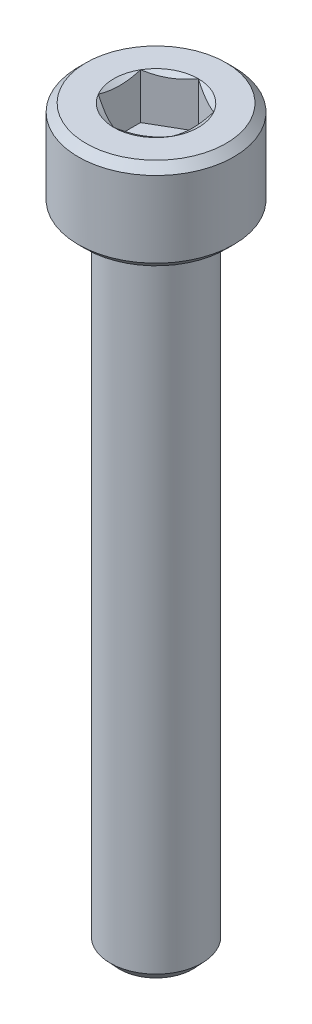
ISO-10303-21;
HEADER;
FILE_DESCRIPTION(('STEP AP214'),'2;1');
FILE_NAME('part.step','',(''),(''),'','','');
FILE_SCHEMA(('AUTOMOTIVE_DESIGN { 1 0 10303 214 1 1 1 1 }'));
ENDSEC;
DATA;
#1=APPLICATION_CONTEXT('core data for automotive mechanical design processes');
#2=APPLICATION_PROTOCOL_DEFINITION('international standard','automotive_design',2000,#1);
#3=PRODUCT_CONTEXT('',#1,'mechanical');
#4=PRODUCT('Part','Part','',(#3));
#5=PRODUCT_RELATED_PRODUCT_CATEGORY('part','',(#4));
#6=PRODUCT_DEFINITION_FORMATION('','',#4);
#7=PRODUCT_DEFINITION_CONTEXT('part definition',#1,'design');
#8=PRODUCT_DEFINITION('design','',#6,#7);
#9=PRODUCT_DEFINITION_SHAPE('','',#8);
#10=(LENGTH_UNIT() NAMED_UNIT(*) SI_UNIT(.MILLI.,.METRE.));
#11=(NAMED_UNIT(*) PLANE_ANGLE_UNIT() SI_UNIT($,.RADIAN.));
#12=(NAMED_UNIT(*) SI_UNIT($,.STERADIAN.) SOLID_ANGLE_UNIT());
#13=UNCERTAINTY_MEASURE_WITH_UNIT(LENGTH_MEASURE(1.E-05),#10,'distance_accuracy_value','');
#14=(GEOMETRIC_REPRESENTATION_CONTEXT(3) GLOBAL_UNCERTAINTY_ASSIGNED_CONTEXT((#13)) GLOBAL_UNIT_ASSIGNED_CONTEXT((#10,
#11,#12)) REPRESENTATION_CONTEXT('',''));
#15=CARTESIAN_POINT('',(0.,0.,0.));
#16=DIRECTION('',(0.,0.,1.));
#17=DIRECTION('',(1.,0.,0.));
#18=AXIS2_PLACEMENT_3D('',#15,#16,#17);
#19=CARTESIAN_POINT('',(0.,2.5,-2.3094010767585));
#20=DIRECTION('',(0.,1.,0.));
#21=DIRECTION('',(-1.,0.,0.));
#22=AXIS2_PLACEMENT_3D('',#19,#20,#21);
#23=PLANE('',#22);
#24=DIRECTION('',(0.866025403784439,0.,-0.499999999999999));
#25=VECTOR('',#24,1.);
#26=CARTESIAN_POINT('',(0.,2.5,2.30940107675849));
#27=LINE('',#26,#25);
#28=CARTESIAN_POINT('',(0.,2.5,2.3094010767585));
#29=VERTEX_POINT('',#28);
#30=CARTESIAN_POINT('',(1.99999999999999,2.5,1.15470053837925));
#31=VERTEX_POINT('',#30);
#32=EDGE_CURVE('E85',#29,#31,#27,.T.);
#33=ORIENTED_EDGE('',*,*,#32,.T.);
#34=DIRECTION('',(0.,0.,-1.));
#35=VECTOR('',#34,1.);
#36=CARTESIAN_POINT('',(1.99999999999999,2.5,1.15470053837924));
#37=LINE('',#36,#35);
#38=CARTESIAN_POINT('',(1.99999999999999,2.5,-1.15470053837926));
#39=VERTEX_POINT('',#38);
#40=EDGE_CURVE('E71',#31,#39,#37,.T.);
#41=ORIENTED_EDGE('',*,*,#40,.T.);
#42=DIRECTION('',(-0.866025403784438,0.,-0.5));
#43=VECTOR('',#42,1.);
#44=CARTESIAN_POINT('',(1.99999999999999,2.5,-1.15470053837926));
#45=LINE('',#44,#43);
#46=CARTESIAN_POINT('',(0.,2.5,-2.30940107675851));
#47=VERTEX_POINT('',#46);
#48=EDGE_CURVE('E110',#39,#47,#45,.T.);
#49=ORIENTED_EDGE('',*,*,#48,.T.);
#50=DIRECTION('',(-0.86602540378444,0.,0.499999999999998));
#51=VECTOR('',#50,1.);
#52=CARTESIAN_POINT('',(0.,2.5,-2.3094010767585));
#53=LINE('',#52,#51);
#54=CARTESIAN_POINT('',(-2.00000000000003,2.5,-1.15470053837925));
#55=VERTEX_POINT('',#54);
#56=EDGE_CURVE('E115',#47,#55,#53,.T.);
#57=ORIENTED_EDGE('',*,*,#56,.T.);
#58=DIRECTION('',(0.,0.,1.));
#59=VECTOR('',#58,1.);
#60=CARTESIAN_POINT('',(-2.00000000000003,2.5,-1.15470053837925));
#61=LINE('',#60,#59);
#62=CARTESIAN_POINT('',(-2.00000000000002,2.5,1.15470053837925));
#63=VERTEX_POINT('',#62);
#64=EDGE_CURVE('E82',#55,#63,#61,.T.);
#65=ORIENTED_EDGE('',*,*,#64,.T.);
#66=DIRECTION('',(0.866025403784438,0.,0.5));
#67=VECTOR('',#66,1.);
#68=CARTESIAN_POINT('',(-2.00000000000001,2.5,1.15470053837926));
#69=LINE('',#68,#67);
#70=EDGE_CURVE('E84',#63,#29,#69,.T.);
#71=ORIENTED_EDGE('',*,*,#70,.T.);
#72=EDGE_LOOP('',(#33,#41,#49,#57,#65,#71));
#73=FACE_BOUND('',#72,.T.);
#74=ADVANCED_FACE('F17',(#73),#23,.T.);
#75=CARTESIAN_POINT('',(0.,2.5,2.30940107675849));
#76=DIRECTION('',(0.499999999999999,0.,0.866025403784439));
#77=DIRECTION('',(0.866025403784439,0.,-0.499999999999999));
#78=AXIS2_PLACEMENT_3D('',#75,#76,#77);
#79=PLANE('',#78);
#80=CARTESIAN_POINT('',(8.41216778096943E-12,5.00000000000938,2.30940107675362));
#81=CARTESIAN_POINT('',(0.0878878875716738,4.97069554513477,2.25865898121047));
#82=CARTESIAN_POINT('',(0.176534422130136,4.94404467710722,2.20747888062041));
#83=CARTESIAN_POINT('',(0.35536234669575,4.8975263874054,2.10423253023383));
#84=CARTESIAN_POINT('',(0.445546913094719,4.8776754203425,2.05216444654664));
#85=CARTESIAN_POINT('',(0.624798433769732,4.84677595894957,1.94867353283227));
#86=CARTESIAN_POINT('',(0.713837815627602,4.83552178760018,1.89726662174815));
#87=CARTESIAN_POINT('',(0.892335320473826,4.82208916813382,1.79421103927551));
#88=CARTESIAN_POINT('',(0.981792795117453,4.81989959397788,1.74256274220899));
#89=CARTESIAN_POINT('',(1.1489344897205,4.82446629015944,1.6460634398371));
#90=CARTESIAN_POINT('',(1.22664379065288,4.83010128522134,1.60119795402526));
#91=CARTESIAN_POINT('',(1.3815561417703,4.84795730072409,1.51175926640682));
#92=CARTESIAN_POINT('',(1.4587586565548,4.86018441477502,1.46718637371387));
#93=CARTESIAN_POINT('',(1.61399014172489,4.89074983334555,1.37756343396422));
#94=CARTESIAN_POINT('',(1.69199947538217,4.90921764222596,1.33252472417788));
#95=CARTESIAN_POINT('',(1.84685497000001,4.95113176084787,1.24311886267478));
#96=CARTESIAN_POINT('',(1.92370311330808,4.97456822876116,1.19875056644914));
#97=CARTESIAN_POINT('',(1.99999999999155,5.00000000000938,1.15470053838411));
#98=B_SPLINE_CURVE_WITH_KNOTS('',3,(#80,#81,#82,#83,#84,#85,#86,#87,#88,#89,#90,#91,#92,#93,#94,
#95,#96,#97),.UNSPECIFIED.,.F.,.F.,(4,2,2,2,2,2,2,2,4),(0.,0.317016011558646,0.634793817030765,
0.94470760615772,1.25424088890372,1.52370778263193,1.79342419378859,2.06912162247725,
2.34427797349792),.UNSPECIFIED.);
#99=CARTESIAN_POINT('',(0.,5.00000000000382,2.309401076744));
#100=VERTEX_POINT('',#99);
#101=CARTESIAN_POINT('',(1.99999999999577,5.00000000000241,1.15470053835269));
#102=VERTEX_POINT('',#101);
#103=EDGE_CURVE('E20',#100,#102,#98,.T.);
#104=ORIENTED_EDGE('',*,*,#103,.T.);
#105=DIRECTION('',(0.,1.,0.));
#106=VECTOR('',#105,1.);
#107=CARTESIAN_POINT('',(1.99999999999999,2.5,1.15470053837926));
#108=LINE('',#107,#106);
#109=EDGE_CURVE('E90',#102,#31,#108,.F.);
#110=ORIENTED_EDGE('',*,*,#109,.T.);
#111=ORIENTED_EDGE('',*,*,#32,.F.);
#112=DIRECTION('',(0.,1.,0.));
#113=VECTOR('',#112,1.);
#114=CARTESIAN_POINT('',(0.,2.5,2.3094010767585));
#115=LINE('',#114,#113);
#116=EDGE_CURVE('E58',#29,#100,#115,.T.);
#117=ORIENTED_EDGE('',*,*,#116,.T.);
#118=EDGE_LOOP('',(#104,#110,#111,#117));
#119=FACE_BOUND('',#118,.T.);
#120=ADVANCED_FACE('F89',(#119),#79,.F.);
#121=CARTESIAN_POINT('',(-2.00000000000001,2.5,1.15470053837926));
#122=DIRECTION('',(-0.5,0.,0.866025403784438));
#123=DIRECTION('',(0.866025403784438,0.,0.5));
#124=AXIS2_PLACEMENT_3D('',#121,#122,#123);
#125=PLANE('',#124);
#126=CARTESIAN_POINT('',(-1.99999999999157,5.00000000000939,1.15470053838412));
#127=CARTESIAN_POINT('',(-1.91211211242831,4.97069554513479,1.20544263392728));
#128=CARTESIAN_POINT('',(-1.82346557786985,4.94404467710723,1.25662273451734));
#129=CARTESIAN_POINT('',(-1.64463765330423,4.89752638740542,1.35986908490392));
#130=CARTESIAN_POINT('',(-1.55445308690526,4.87767542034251,1.41193716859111));
#131=CARTESIAN_POINT('',(-1.37520156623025,4.84677595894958,1.51542808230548));
#132=CARTESIAN_POINT('',(-1.28616218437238,4.8355217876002,1.5668349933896));
#133=CARTESIAN_POINT('',(-1.10766467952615,4.82208916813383,1.66989057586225));
#134=CARTESIAN_POINT('',(-1.01820720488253,4.81989959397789,1.72153887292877));
#135=CARTESIAN_POINT('',(-0.851065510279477,4.82446629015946,1.81803817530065));
#136=CARTESIAN_POINT('',(-0.773356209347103,4.83010128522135,1.86290366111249));
#137=CARTESIAN_POINT('',(-0.618443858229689,4.84795730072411,1.95234234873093));
#138=CARTESIAN_POINT('',(-0.54124134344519,4.86018441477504,1.99691524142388));
#139=CARTESIAN_POINT('',(-0.386009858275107,4.89074983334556,2.08653818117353));
#140=CARTESIAN_POINT('',(-0.308000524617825,4.90921764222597,2.13157689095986));
#141=CARTESIAN_POINT('',(-0.153145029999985,4.95113176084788,2.22098275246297));
#142=CARTESIAN_POINT('',(-0.0762968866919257,4.97456822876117,2.2653510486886));
#143=CARTESIAN_POINT('',(-8.45044942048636E-12,5.00000000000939,2.30940107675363));
#144=B_SPLINE_CURVE_WITH_KNOTS('',3,(#126,#127,#128,#129,#130,#131,#132,#133,#134,#135,#136,
#137,#138,#139,#140,#141,#142,#143),.UNSPECIFIED.,.F.,.F.,(4,2,2,2,2,2,2,2,4),(0.,
0.317016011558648,0.63479381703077,0.944707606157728,1.25424088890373,1.52370778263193,
1.79342419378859,2.06912162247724,2.3442779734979),.UNSPECIFIED.);
#145=CARTESIAN_POINT('',(-1.99999999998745,5.00000000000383,1.154700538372));
#146=VERTEX_POINT('',#145);
#147=EDGE_CURVE('E94',#146,#100,#144,.T.);
#148=ORIENTED_EDGE('',*,*,#147,.T.);
#149=ORIENTED_EDGE('',*,*,#116,.F.);
#150=ORIENTED_EDGE('',*,*,#70,.F.);
#151=DIRECTION('',(0.,1.,0.));
#152=VECTOR('',#151,1.);
#153=CARTESIAN_POINT('',(-2.00000000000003,2.5,1.15470053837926));
#154=LINE('',#153,#152);
#155=EDGE_CURVE('E96',#63,#146,#154,.T.);
#156=ORIENTED_EDGE('',*,*,#155,.T.);
#157=EDGE_LOOP('',(#148,#149,#150,#156));
#158=FACE_BOUND('',#157,.T.);
#159=ADVANCED_FACE('F92',(#158),#125,.F.);
#160=CARTESIAN_POINT('',(-2.00000000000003,2.5,-1.15470053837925));
#161=DIRECTION('',(-1.,0.,0.));
#162=DIRECTION('',(0.,0.,1.));
#163=AXIS2_PLACEMENT_3D('',#160,#161,#162);
#164=PLANE('',#163);
#165=CARTESIAN_POINT('',(-2.00000000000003,5.0000000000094,-1.15470053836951));
#166=CARTESIAN_POINT('',(-2.00000000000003,4.97069554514,-1.05321634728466));
#167=CARTESIAN_POINT('',(-2.00000000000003,4.94404467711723,-0.95085614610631));
#168=CARTESIAN_POINT('',(-2.00000000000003,4.89752638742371,-0.744363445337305));
#169=CARTESIAN_POINT('',(-2.00000000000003,4.8776754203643,-0.640227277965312));
#170=CARTESIAN_POINT('',(-2.00000000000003,4.8467759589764,-0.433245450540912));
#171=CARTESIAN_POINT('',(-2.00000000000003,4.83552178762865,-0.330431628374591));
#172=CARTESIAN_POINT('',(-2.00000000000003,4.82208916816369,-0.124320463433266));
#173=CARTESIAN_POINT('',(-2.00000000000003,4.81989959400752,-0.0210238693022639));
#174=CARTESIAN_POINT('',(-2.00000000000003,4.824466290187,0.171974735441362));
#175=CARTESIAN_POINT('',(-2.00000000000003,4.83010128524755,0.261705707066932));
#176=CARTESIAN_POINT('',(-2.00000000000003,4.84795730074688,0.440583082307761));
#177=CARTESIAN_POINT('',(-2.00000000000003,4.86018441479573,0.529728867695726));
#178=CARTESIAN_POINT('',(-2.00000000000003,4.89074983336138,0.708974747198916));
#179=CARTESIAN_POINT('',(-2.00000000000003,4.90921764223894,0.799052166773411));
#180=CARTESIAN_POINT('',(-2.00000000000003,4.95113176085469,0.977863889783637));
#181=CARTESIAN_POINT('',(-2.00000000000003,4.97456822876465,1.06660048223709));
#182=CARTESIAN_POINT('',(-2.00000000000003,5.0000000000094,1.15470053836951));
#183=B_SPLINE_CURVE_WITH_KNOTS('',3,(#165,#166,#167,#168,#169,#170,#171,#172,#173,#174,#175,
#176,#177,#178,#179,#180,#181,#182),.UNSPECIFIED.,.F.,.F.,(4,2,2,2,2,2,2,2,4),(0.,
0.31701601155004,0.634793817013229,0.944707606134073,1.25424088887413,1.52370778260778,
1.7934241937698,2.06912162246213,2.34427797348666),.UNSPECIFIED.);
#184=CARTESIAN_POINT('',(-1.99999999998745,5.00000000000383,-1.154700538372));
#185=VERTEX_POINT('',#184);
#186=EDGE_CURVE('E195',#185,#146,#183,.T.);
#187=ORIENTED_EDGE('',*,*,#186,.T.);
#188=ORIENTED_EDGE('',*,*,#155,.F.);
#189=ORIENTED_EDGE('',*,*,#64,.F.);
#190=DIRECTION('',(0.,1.,0.));
#191=VECTOR('',#190,1.);
#192=CARTESIAN_POINT('',(-2.00000000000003,2.5,-1.15470053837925));
#193=LINE('',#192,#191);
#194=EDGE_CURVE('E112',#55,#185,#193,.T.);
#195=ORIENTED_EDGE('',*,*,#194,.T.);
#196=EDGE_LOOP('',(#187,#188,#189,#195));
#197=FACE_BOUND('',#196,.T.);
#198=ADVANCED_FACE('F204',(#197),#164,.F.);
#199=CARTESIAN_POINT('',(0.,2.5,-2.3094010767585));
#200=DIRECTION('',(-0.499999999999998,0.,-0.86602540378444));
#201=DIRECTION('',(-0.86602540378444,0.,0.499999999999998));
#202=AXIS2_PLACEMENT_3D('',#199,#200,#201);
#203=PLANE('',#202);
#204=CARTESIAN_POINT('',(-8.44226296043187E-12,5.00000000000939,-2.30940107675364));
#205=CARTESIAN_POINT('',(-0.0878878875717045,4.97069554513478,-2.25865898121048));
#206=CARTESIAN_POINT('',(-0.176534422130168,4.94404467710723,-2.20747888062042));
#207=CARTESIAN_POINT('',(-0.355362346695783,4.89752638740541,-2.10423253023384));
#208=CARTESIAN_POINT('',(-0.445546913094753,4.87767542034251,-2.05216444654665));
#209=CARTESIAN_POINT('',(-0.624798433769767,4.84677595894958,-1.94867353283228));
#210=CARTESIAN_POINT('',(-0.713837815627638,4.8355217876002,-1.89726662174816));
#211=CARTESIAN_POINT('',(-0.892335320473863,4.82208916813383,-1.79421103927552));
#212=CARTESIAN_POINT('',(-0.981792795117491,4.81989959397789,-1.742562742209));
#213=CARTESIAN_POINT('',(-1.14893448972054,4.82446629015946,-1.64606343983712));
#214=CARTESIAN_POINT('',(-1.22664379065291,4.83010128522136,-1.60119795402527));
#215=CARTESIAN_POINT('',(-1.38155614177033,4.84795730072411,-1.51175926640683));
#216=CARTESIAN_POINT('',(-1.45875865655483,4.86018441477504,-1.46718637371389));
#217=CARTESIAN_POINT('',(-1.61399014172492,4.89074983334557,-1.37756343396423));
#218=CARTESIAN_POINT('',(-1.6919994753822,4.90921764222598,-1.3325247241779));
#219=CARTESIAN_POINT('',(-1.84685497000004,4.95113176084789,-1.24311886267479));
#220=CARTESIAN_POINT('',(-1.9237031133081,4.97456822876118,-1.19875056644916));
#221=CARTESIAN_POINT('',(-1.99999999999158,5.00000000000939,-1.15470053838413));
#222=B_SPLINE_CURVE_WITH_KNOTS('',3,(#204,#205,#206,#207,#208,#209,#210,#211,#212,#213,#214,
#215,#216,#217,#218,#219,#220,#221),.UNSPECIFIED.,.F.,.F.,(4,2,2,2,2,2,2,2,4),(0.,
0.317016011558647,0.634793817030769,0.944707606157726,1.25424088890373,1.52370778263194,
1.79342419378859,2.06912162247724,2.34427797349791),.UNSPECIFIED.);
#223=CARTESIAN_POINT('',(0.,5.00000000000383,-2.30940107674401));
#224=VERTEX_POINT('',#223);
#225=EDGE_CURVE('E188',#224,#185,#222,.T.);
#226=ORIENTED_EDGE('',*,*,#225,.T.);
#227=ORIENTED_EDGE('',*,*,#194,.F.);
#228=ORIENTED_EDGE('',*,*,#56,.F.);
#229=DIRECTION('',(0.,1.,0.));
#230=VECTOR('',#229,1.);
#231=CARTESIAN_POINT('',(0.,2.5,-2.30940107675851));
#232=LINE('',#231,#230);
#233=EDGE_CURVE('E107',#47,#224,#232,.T.);
#234=ORIENTED_EDGE('',*,*,#233,.T.);
#235=EDGE_LOOP('',(#226,#227,#228,#234));
#236=FACE_BOUND('',#235,.T.);
#237=ADVANCED_FACE('F200',(#236),#203,.F.);
#238=CARTESIAN_POINT('',(1.99999999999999,2.5,-1.15470053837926));
#239=DIRECTION('',(0.5,0.,-0.866025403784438));
#240=DIRECTION('',(-0.866025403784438,0.,-0.5));
#241=AXIS2_PLACEMENT_3D('',#238,#239,#240);
#242=PLANE('',#241);
#243=CARTESIAN_POINT('',(1.99999999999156,5.00000000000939,-1.15470053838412));
#244=CARTESIAN_POINT('',(1.9121121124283,4.97069554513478,-1.20544263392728));
#245=CARTESIAN_POINT('',(1.82346557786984,4.94404467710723,-1.25662273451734));
#246=CARTESIAN_POINT('',(1.64463765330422,4.89752638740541,-1.35986908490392));
#247=CARTESIAN_POINT('',(1.55445308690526,4.8776754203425,-1.41193716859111));
#248=CARTESIAN_POINT('',(1.37520156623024,4.84677595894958,-1.51542808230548));
#249=CARTESIAN_POINT('',(1.28616218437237,4.83552178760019,-1.5668349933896));
#250=CARTESIAN_POINT('',(1.10766467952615,4.82208916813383,-1.66989057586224));
#251=CARTESIAN_POINT('',(1.01820720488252,4.81989959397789,-1.72153887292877));
#252=CARTESIAN_POINT('',(0.851065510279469,4.82446629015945,-1.81803817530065));
#253=CARTESIAN_POINT('',(0.773356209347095,4.83010128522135,-1.86290366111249));
#254=CARTESIAN_POINT('',(0.618443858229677,4.84795730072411,-1.95234234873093));
#255=CARTESIAN_POINT('',(0.541241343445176,4.86018441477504,-1.99691524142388));
#256=CARTESIAN_POINT('',(0.38600985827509,4.89074983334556,-2.08653818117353));
#257=CARTESIAN_POINT('',(0.308000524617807,4.90921764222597,-2.13157689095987));
#258=CARTESIAN_POINT('',(0.153145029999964,4.95113176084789,-2.22098275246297));
#259=CARTESIAN_POINT('',(0.0762968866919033,4.97456822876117,-2.26535104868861));
#260=CARTESIAN_POINT('',(8.42673736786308E-12,5.00000000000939,-2.30940107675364));
#261=B_SPLINE_CURVE_WITH_KNOTS('',3,(#243,#244,#245,#246,#247,#248,#249,#250,#251,#252,#253,
#254,#255,#256,#257,#258,#259,#260),.UNSPECIFIED.,.F.,.F.,(4,2,2,2,2,2,2,2,4),(0.,
0.317016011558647,0.634793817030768,0.944707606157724,1.25424088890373,1.52370778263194,
1.79342419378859,2.06912162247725,2.34427797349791),.UNSPECIFIED.);
#262=CARTESIAN_POINT('',(1.99999999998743,5.00000000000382,-1.154700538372));
#263=VERTEX_POINT('',#262);
#264=EDGE_CURVE('E159',#263,#224,#261,.T.);
#265=ORIENTED_EDGE('',*,*,#264,.T.);
#266=ORIENTED_EDGE('',*,*,#233,.F.);
#267=ORIENTED_EDGE('',*,*,#48,.F.);
#268=DIRECTION('',(0.,1.,0.));
#269=VECTOR('',#268,1.);
#270=CARTESIAN_POINT('',(1.99999999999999,2.5,-1.15470053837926));
#271=LINE('',#270,#269);
#272=EDGE_CURVE('E39',#39,#263,#271,.T.);
#273=ORIENTED_EDGE('',*,*,#272,.T.);
#274=EDGE_LOOP('',(#265,#266,#267,#273));
#275=FACE_BOUND('',#274,.T.);
#276=ADVANCED_FACE('F203',(#275),#242,.F.);
#277=CARTESIAN_POINT('',(1.99999999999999,2.5,1.15470053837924));
#278=DIRECTION('',(1.,0.,0.));
#279=DIRECTION('',(0.,0.,-1.));
#280=AXIS2_PLACEMENT_3D('',#277,#278,#279);
#281=PLANE('',#280);
#282=CARTESIAN_POINT('',(1.99999999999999,5.00000000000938,1.15470053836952));
#283=CARTESIAN_POINT('',(1.99999999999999,4.97069554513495,1.05321634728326));
#284=CARTESIAN_POINT('',(1.99999999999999,4.94404467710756,0.950856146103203));
#285=CARTESIAN_POINT('',(1.99999999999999,4.89752638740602,0.744363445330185));
#286=CARTESIAN_POINT('',(1.99999999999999,4.87767542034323,0.640227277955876));
#287=CARTESIAN_POINT('',(1.99999999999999,4.84677595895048,0.433245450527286));
#288=CARTESIAN_POINT('',(1.99999999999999,4.83552178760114,0.330431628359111));
#289=CARTESIAN_POINT('',(1.99999999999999,4.82208916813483,0.124320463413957));
#290=CARTESIAN_POINT('',(1.99999999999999,4.81989959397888,0.0210238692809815));
#291=CARTESIAN_POINT('',(1.99999999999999,4.82446629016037,-0.171974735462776));
#292=CARTESIAN_POINT('',(1.99999999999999,4.83010128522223,-0.261705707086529));
#293=CARTESIAN_POINT('',(1.99999999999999,4.84795730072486,-0.440583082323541));
#294=CARTESIAN_POINT('',(1.99999999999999,4.86018441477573,-0.529728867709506));
#295=CARTESIAN_POINT('',(1.99999999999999,4.89074983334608,-0.708974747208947));
#296=CARTESIAN_POINT('',(1.99999999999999,4.9092176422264,-0.799052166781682));
#297=CARTESIAN_POINT('',(1.99999999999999,4.95113176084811,-0.977863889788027));
#298=CARTESIAN_POINT('',(1.99999999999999,4.97456822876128,-1.06660048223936));
#299=CARTESIAN_POINT('',(1.99999999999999,5.00000000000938,-1.15470053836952));
#300=B_SPLINE_CURVE_WITH_KNOTS('',3,(#282,#283,#284,#285,#286,#287,#288,#289,#290,#291,#292,
#293,#294,#295,#296,#297,#298,#299),.UNSPECIFIED.,.F.,.F.,(4,2,2,2,2,2,2,2,4),(0.,
0.317016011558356,0.634793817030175,0.944707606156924,1.25424088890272,1.52370778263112,
1.79342419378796,2.06912162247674,2.34427797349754),.UNSPECIFIED.);
#301=EDGE_CURVE('E152',#102,#263,#300,.T.);
#302=ORIENTED_EDGE('',*,*,#301,.T.);
#303=ORIENTED_EDGE('',*,*,#272,.F.);
#304=ORIENTED_EDGE('',*,*,#40,.F.);
#305=ORIENTED_EDGE('',*,*,#109,.F.);
#306=EDGE_LOOP('',(#302,#303,#304,#305));
#307=FACE_BOUND('',#306,.T.);
#308=ADVANCED_FACE('F166',(#307),#281,.F.);
#309=CARTESIAN_POINT('',(0.,4.99999999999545,0.));
#310=DIRECTION('',(0.,1.,0.));
#311=DIRECTION('',(0.,0.,1.));
#312=AXIS2_PLACEMENT_3D('',#309,#310,#311);
#313=CONICAL_SURFACE('',#312,2.3094010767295,1.0471975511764);
#314=ORIENTED_EDGE('',*,*,#103,.F.);
#315=CARTESIAN_POINT('',(0.,4.99999999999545,0.));
#316=DIRECTION('',(0.,1.,0.));
#317=DIRECTION('',(0.,0.,1.));
#318=AXIS2_PLACEMENT_3D('',#315,#316,#317);
#319=CIRCLE('',#318,2.3094010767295);
#320=EDGE_CURVE('E149',#102,#100,#319,.F.);
#321=ORIENTED_EDGE('',*,*,#320,.F.);
#322=EDGE_LOOP('',(#314,#321));
#323=FACE_BOUND('',#322,.T.);
#324=ADVANCED_FACE('F220',(#323),#313,.F.);
#325=CARTESIAN_POINT('',(0.,4.99999999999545,0.));
#326=DIRECTION('',(0.,1.,0.));
#327=DIRECTION('',(0.,0.,1.));
#328=AXIS2_PLACEMENT_3D('',#325,#326,#327);
#329=CONICAL_SURFACE('',#328,2.3094010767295,1.0471975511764);
#330=ORIENTED_EDGE('',*,*,#147,.F.);
#331=CARTESIAN_POINT('',(0.,4.99999999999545,0.));
#332=DIRECTION('',(0.,1.,0.));
#333=DIRECTION('',(0.,0.,1.));
#334=AXIS2_PLACEMENT_3D('',#331,#332,#333);
#335=CIRCLE('',#334,2.3094010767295);
#336=EDGE_CURVE('E146',#100,#146,#335,.F.);
#337=ORIENTED_EDGE('',*,*,#336,.F.);
#338=EDGE_LOOP('',(#330,#337));
#339=FACE_BOUND('',#338,.T.);
#340=ADVANCED_FACE('F217',(#339),#329,.F.);
#341=CARTESIAN_POINT('',(0.,4.99999999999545,0.));
#342=DIRECTION('',(0.,1.,0.));
#343=DIRECTION('',(0.,0.,1.));
#344=AXIS2_PLACEMENT_3D('',#341,#342,#343);
#345=CONICAL_SURFACE('',#344,2.3094010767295,1.04719755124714);
#346=ORIENTED_EDGE('',*,*,#186,.F.);
#347=CARTESIAN_POINT('',(0.,4.99999999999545,0.));
#348=DIRECTION('',(0.,1.,0.));
#349=DIRECTION('',(0.,0.,1.));
#350=AXIS2_PLACEMENT_3D('',#347,#348,#349);
#351=CIRCLE('',#350,2.3094010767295);
#352=EDGE_CURVE('E143',#146,#185,#351,.F.);
#353=ORIENTED_EDGE('',*,*,#352,.F.);
#354=EDGE_LOOP('',(#346,#353));
#355=FACE_BOUND('',#354,.T.);
#356=ADVANCED_FACE('F184',(#355),#345,.F.);
#357=CARTESIAN_POINT('',(0.,4.99999999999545,0.));
#358=DIRECTION('',(0.,1.,0.));
#359=DIRECTION('',(0.,0.,1.));
#360=AXIS2_PLACEMENT_3D('',#357,#358,#359);
#361=CONICAL_SURFACE('',#360,2.3094010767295,1.0471975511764);
#362=ORIENTED_EDGE('',*,*,#225,.F.);
#363=CARTESIAN_POINT('',(0.,4.99999999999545,0.));
#364=DIRECTION('',(0.,1.,0.));
#365=DIRECTION('',(0.,0.,1.));
#366=AXIS2_PLACEMENT_3D('',#363,#364,#365);
#367=CIRCLE('',#366,2.3094010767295);
#368=EDGE_CURVE('E140',#185,#224,#367,.F.);
#369=ORIENTED_EDGE('',*,*,#368,.F.);
#370=EDGE_LOOP('',(#362,#369));
#371=FACE_BOUND('',#370,.T.);
#372=ADVANCED_FACE('F179',(#371),#361,.F.);
#373=CARTESIAN_POINT('',(0.,4.99999999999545,0.));
#374=DIRECTION('',(0.,1.,0.));
#375=DIRECTION('',(0.,0.,1.));
#376=AXIS2_PLACEMENT_3D('',#373,#374,#375);
#377=CONICAL_SURFACE('',#376,2.3094010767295,1.0471975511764);
#378=ORIENTED_EDGE('',*,*,#264,.F.);
#379=CARTESIAN_POINT('',(0.,4.99999999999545,0.));
#380=DIRECTION('',(0.,1.,0.));
#381=DIRECTION('',(0.,0.,1.));
#382=AXIS2_PLACEMENT_3D('',#379,#380,#381);
#383=CIRCLE('',#382,2.3094010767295);
#384=EDGE_CURVE('E137',#224,#263,#383,.F.);
#385=ORIENTED_EDGE('',*,*,#384,.F.);
#386=EDGE_LOOP('',(#378,#385));
#387=FACE_BOUND('',#386,.T.);
#388=ADVANCED_FACE('F173',(#387),#377,.F.);
#389=CARTESIAN_POINT('',(0.,4.99999999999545,0.));
#390=DIRECTION('',(0.,1.,0.));
#391=DIRECTION('',(0.,0.,1.));
#392=AXIS2_PLACEMENT_3D('',#389,#390,#391);
#393=CONICAL_SURFACE('',#392,2.3094010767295,1.04719755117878);
#394=ORIENTED_EDGE('',*,*,#301,.F.);
#395=CARTESIAN_POINT('',(0.,4.99999999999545,0.));
#396=DIRECTION('',(0.,1.,0.));
#397=DIRECTION('',(0.,0.,1.));
#398=AXIS2_PLACEMENT_3D('',#395,#396,#397);
#399=CIRCLE('',#398,2.3094010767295);
#400=EDGE_CURVE('E134',#263,#102,#399,.F.);
#401=ORIENTED_EDGE('',*,*,#400,.F.);
#402=EDGE_LOOP('',(#394,#401));
#403=FACE_BOUND('',#402,.T.);
#404=ADVANCED_FACE('F168',(#403),#393,.F.);
#405=CARTESIAN_POINT('',(0.,5.,0.));
#406=DIRECTION('',(0.,1.,0.));
#407=DIRECTION('',(-1.,0.,0.));
#408=AXIS2_PLACEMENT_3D('',#405,#406,#407);
#409=PLANE('',#408);
#410=ORIENTED_EDGE('',*,*,#384,.T.);
#411=ORIENTED_EDGE('',*,*,#400,.T.);
#412=ORIENTED_EDGE('',*,*,#320,.T.);
#413=ORIENTED_EDGE('',*,*,#336,.T.);
#414=ORIENTED_EDGE('',*,*,#352,.T.);
#415=ORIENTED_EDGE('',*,*,#368,.T.);
#416=EDGE_LOOP('',(#410,#411,#412,#413,#414,#415));
#417=FACE_BOUND('',#416,.T.);
#418=CARTESIAN_POINT('',(0.,4.99999999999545,0.));
#419=DIRECTION('',(0.,-1.,0.));
#420=DIRECTION('',(0.,0.,-1.));
#421=AXIS2_PLACEMENT_3D('',#418,#419,#420);
#422=CIRCLE('',#421,3.82500000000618);
#423=CARTESIAN_POINT('',(0.,4.99999999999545,-3.82500000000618));
#424=VERTEX_POINT('',#423);
#425=EDGE_CURVE('E130',#424,#424,#422,.T.);
#426=ORIENTED_EDGE('',*,*,#425,.F.);
#427=EDGE_LOOP('',(#426));
#428=FACE_BOUND('',#427,.T.);
#429=ADVANCED_FACE('F172',(#417,#428),#409,.T.);
#430=CARTESIAN_POINT('',(0.,4.57500000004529,0.));
#431=DIRECTION('',(0.,-1.,0.));
#432=DIRECTION('',(0.,0.,-1.));
#433=AXIS2_PLACEMENT_3D('',#430,#431,#432);
#434=CONICAL_SURFACE('',#433,4.25000000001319,0.785398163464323);
#435=ORIENTED_EDGE('',*,*,#425,.T.);
#436=EDGE_LOOP('',(#435));
#437=FACE_BOUND('',#436,.T.);
#438=CARTESIAN_POINT('',(0.,4.575,0.));
#439=DIRECTION('',(0.,-1.,0.));
#440=DIRECTION('',(1.,0.,0.));
#441=AXIS2_PLACEMENT_3D('',#438,#439,#440);
#442=CIRCLE('',#441,4.25000000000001);
#443=CARTESIAN_POINT('',(4.25000000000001,4.575,0.));
#444=VERTEX_POINT('',#443);
#445=EDGE_CURVE('E133',#444,#444,#442,.T.);
#446=ORIENTED_EDGE('',*,*,#445,.F.);
#447=EDGE_LOOP('',(#446));
#448=FACE_BOUND('',#447,.T.);
#449=ADVANCED_FACE('F256',(#437,#448),#434,.T.);
#450=CARTESIAN_POINT('',(0.,5.,0.));
#451=DIRECTION('',(0.,-1.,0.));
#452=DIRECTION('',(1.,0.,0.));
#453=AXIS2_PLACEMENT_3D('',#450,#451,#452);
#454=CYLINDRICAL_SURFACE('',#453,4.25000000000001);
#455=ORIENTED_EDGE('',*,*,#445,.T.);
#456=EDGE_LOOP('',(#455));
#457=FACE_BOUND('',#456,.T.);
#458=CARTESIAN_POINT('',(0.,0.425000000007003,0.));
#459=DIRECTION('',(0.,1.,0.));
#460=DIRECTION('',(0.,0.,1.));
#461=AXIS2_PLACEMENT_3D('',#458,#459,#460);
#462=CIRCLE('',#461,4.25000000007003);
#463=CARTESIAN_POINT('',(0.,0.425000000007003,4.25000000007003));
#464=VERTEX_POINT('',#463);
#465=EDGE_CURVE('E129',#464,#464,#462,.F.);
#466=ORIENTED_EDGE('',*,*,#465,.F.);
#467=EDGE_LOOP('',(#466));
#468=FACE_BOUND('',#467,.T.);
#469=ADVANCED_FACE('F253',(#457,#468),#454,.T.);
#470=CARTESIAN_POINT('',(0.,-35.,0.));
#471=DIRECTION('',(0.,1.,0.));
#472=DIRECTION('',(-1.,0.,0.));
#473=AXIS2_PLACEMENT_3D('',#470,#471,#472);
#474=PLANE('',#473);
#475=CARTESIAN_POINT('',(0.,-35.000000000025,0.));
#476=DIRECTION('',(0.,1.,0.));
#477=DIRECTION('',(0.,0.,1.));
#478=AXIS2_PLACEMENT_3D('',#475,#476,#477);
#479=CIRCLE('',#478,2.00000000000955);
#480=CARTESIAN_POINT('',(0.,-35.000000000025,2.00000000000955));
#481=VERTEX_POINT('',#480);
#482=EDGE_CURVE('E126',#481,#481,#479,.T.);
#483=ORIENTED_EDGE('',*,*,#482,.F.);
#484=EDGE_LOOP('',(#483));
#485=FACE_BOUND('',#484,.T.);
#486=ADVANCED_FACE('F249',(#485),#474,.F.);
#487=CARTESIAN_POINT('',(0.,0.42499999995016,0.));
#488=DIRECTION('',(0.,1.,0.));
#489=DIRECTION('',(0.,0.,1.));
#490=AXIS2_PLACEMENT_3D('',#487,#488,#489);
#491=CONICAL_SURFACE('',#490,4.24999999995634,0.785398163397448);
#492=CARTESIAN_POINT('',(0.,0.,0.));
#493=DIRECTION('',(0.,1.,0.));
#494=DIRECTION('',(0.,0.,1.));
#495=AXIS2_PLACEMENT_3D('',#492,#493,#494);
#496=CIRCLE('',#495,3.82500000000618);
#497=CARTESIAN_POINT('',(0.,0.,3.82500000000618));
#498=VERTEX_POINT('',#497);
#499=EDGE_CURVE('E123',#498,#498,#496,.T.);
#500=ORIENTED_EDGE('',*,*,#499,.T.);
#501=EDGE_LOOP('',(#500));
#502=FACE_BOUND('',#501,.T.);
#503=ORIENTED_EDGE('',*,*,#465,.T.);
#504=EDGE_LOOP('',(#503));
#505=FACE_BOUND('',#504,.T.);
#506=ADVANCED_FACE('F245',(#502,#505),#491,.T.);
#507=CARTESIAN_POINT('',(0.,-34.4638156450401,0.));
#508=DIRECTION('',(0.,1.,0.));
#509=DIRECTION('',(0.,0.,1.));
#510=AXIS2_PLACEMENT_3D('',#507,#508,#509);
#511=CONICAL_SURFACE('',#510,2.49999999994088,0.750491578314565);
#512=CARTESIAN_POINT('',(0.,-34.4638156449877,0.));
#513=DIRECTION('',(0.,1.,0.));
#514=DIRECTION('',(-1.,0.,0.));
#515=AXIS2_PLACEMENT_3D('',#512,#513,#514);
#516=CIRCLE('',#515,2.5);
#517=CARTESIAN_POINT('',(-2.5,-34.4638156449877,0.));
#518=VERTEX_POINT('',#517);
#519=EDGE_CURVE('E30',#518,#518,#516,.T.);
#520=ORIENTED_EDGE('',*,*,#519,.F.);
#521=EDGE_LOOP('',(#520));
#522=FACE_BOUND('',#521,.T.);
#523=ORIENTED_EDGE('',*,*,#482,.T.);
#524=EDGE_LOOP('',(#523));
#525=FACE_BOUND('',#524,.T.);
#526=ADVANCED_FACE('F238',(#522,#525),#511,.T.);
#527=CARTESIAN_POINT('',(0.,0.,0.));
#528=DIRECTION('',(0.,1.,0.));
#529=DIRECTION('',(-1.,0.,0.));
#530=AXIS2_PLACEMENT_3D('',#527,#528,#529);
#531=PLANE('',#530);
#532=CARTESIAN_POINT('',(0.,0.,0.));
#533=DIRECTION('',(0.,1.,0.));
#534=DIRECTION('',(-1.,0.,0.));
#535=AXIS2_PLACEMENT_3D('',#532,#533,#534);
#536=CIRCLE('',#535,2.5);
#537=CARTESIAN_POINT('',(-2.5,0.,0.));
#538=VERTEX_POINT('',#537);
#539=EDGE_CURVE('E11',#538,#538,#536,.F.);
#540=ORIENTED_EDGE('',*,*,#539,.F.);
#541=EDGE_LOOP('',(#540));
#542=FACE_BOUND('',#541,.T.);
#543=ORIENTED_EDGE('',*,*,#499,.F.);
#544=EDGE_LOOP('',(#543));
#545=FACE_BOUND('',#544,.T.);
#546=ADVANCED_FACE('F232',(#542,#545),#531,.F.);
#547=CARTESIAN_POINT('',(0.,-35.,0.));
#548=DIRECTION('',(0.,1.,0.));
#549=DIRECTION('',(-1.,0.,0.));
#550=AXIS2_PLACEMENT_3D('',#547,#548,#549);
#551=CYLINDRICAL_SURFACE('',#550,2.5);
#552=ORIENTED_EDGE('',*,*,#539,.T.);
#553=EDGE_LOOP('',(#552));
#554=FACE_BOUND('',#553,.T.);
#555=ORIENTED_EDGE('',*,*,#519,.T.);
#556=EDGE_LOOP('',(#555));
#557=FACE_BOUND('',#556,.T.);
#558=ADVANCED_FACE('F230',(#554,#557),#551,.T.);
#559=CLOSED_SHELL('',(#74,#120,#159,#198,#237,#276,#308,#324,#340,#356,#372,#388,#404,#429,#449,
#469,#486,#506,#526,#546,#558));
#560=MANIFOLD_SOLID_BREP('B1',#559);
#561=ADVANCED_BREP_SHAPE_REPRESENTATION('',(#18,#560),#14);
#562=SHAPE_DEFINITION_REPRESENTATION(#9,#561);
ENDSEC;
END-ISO-10303-21;
